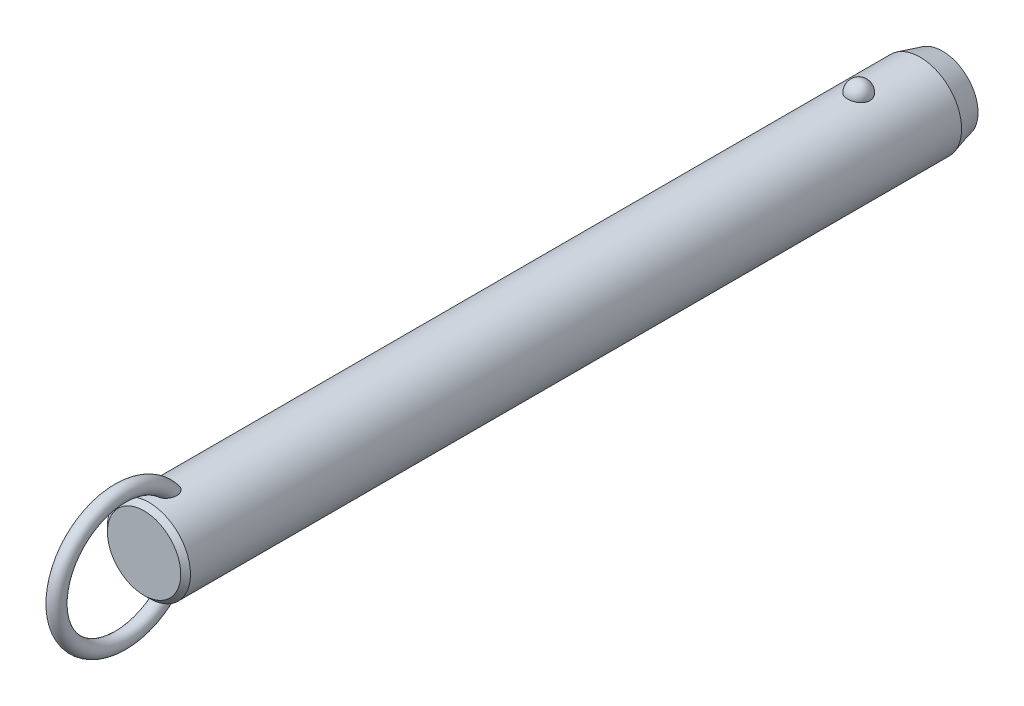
ISO-10303-21;
HEADER;
FILE_DESCRIPTION(('STEP AP214'),'2;1');
FILE_NAME('part.step','',(''),(''),'','','');
FILE_SCHEMA(('AUTOMOTIVE_DESIGN { 1 0 10303 214 1 1 1 1 }'));
ENDSEC;
DATA;
#1=APPLICATION_CONTEXT('core data for automotive mechanical design processes');
#2=APPLICATION_PROTOCOL_DEFINITION('international standard','automotive_design',2000,#1);
#3=PRODUCT_CONTEXT('',#1,'mechanical');
#4=PRODUCT('Part','Part','',(#3));
#5=PRODUCT_RELATED_PRODUCT_CATEGORY('part','',(#4));
#6=PRODUCT_DEFINITION_FORMATION('','',#4);
#7=PRODUCT_DEFINITION_CONTEXT('part definition',#1,'design');
#8=PRODUCT_DEFINITION('design','',#6,#7);
#9=PRODUCT_DEFINITION_SHAPE('','',#8);
#10=(LENGTH_UNIT() NAMED_UNIT(*) SI_UNIT(.MILLI.,.METRE.));
#11=(NAMED_UNIT(*) PLANE_ANGLE_UNIT() SI_UNIT($,.RADIAN.));
#12=(NAMED_UNIT(*) SI_UNIT($,.STERADIAN.) SOLID_ANGLE_UNIT());
#13=UNCERTAINTY_MEASURE_WITH_UNIT(LENGTH_MEASURE(1.E-05),#10,'distance_accuracy_value','');
#14=(GEOMETRIC_REPRESENTATION_CONTEXT(3) GLOBAL_UNCERTAINTY_ASSIGNED_CONTEXT((#13)) GLOBAL_UNIT_ASSIGNED_CONTEXT((#10,
#11,#12)) REPRESENTATION_CONTEXT('',''));
#15=CARTESIAN_POINT('',(0.,0.,0.));
#16=DIRECTION('',(0.,0.,1.));
#17=DIRECTION('',(1.,0.,0.));
#18=AXIS2_PLACEMENT_3D('',#15,#16,#17);
#19=CARTESIAN_POINT('',(0.,0.,175.3));
#20=DIRECTION('',(0.,0.,-1.));
#21=DIRECTION('',(-1.,0.,0.));
#22=AXIS2_PLACEMENT_3D('',#19,#20,#21);
#23=CYLINDRICAL_SURFACE('',#22,11.1);
#24=CARTESIAN_POINT('',(2.9724815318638,10.6945945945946,-3.00000000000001));
#25=CARTESIAN_POINT('',(2.9724783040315,10.6945972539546,-2.8322505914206));
#26=CARTESIAN_POINT('',(2.95876598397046,10.6984356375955,-2.66445972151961));
#27=CARTESIAN_POINT('',(2.90424529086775,10.7133624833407,-2.3336238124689));
#28=CARTESIAN_POINT('',(2.8634252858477,10.7244540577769,-2.17058084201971));
#29=CARTESIAN_POINT('',(2.75573657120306,10.7526272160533,-1.85396767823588));
#30=CARTESIAN_POINT('',(2.68887937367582,10.7697061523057,-1.70039333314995));
#31=CARTESIAN_POINT('',(2.53079696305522,10.8079438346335,-1.4069159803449));
#32=CARTESIAN_POINT('',(2.43957264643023,10.8291024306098,-1.26701246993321));
#33=CARTESIAN_POINT('',(2.23458150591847,10.8732541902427,-1.00409565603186));
#34=CARTESIAN_POINT('',(2.12071295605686,10.8962553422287,-0.88116297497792));
#35=CARTESIAN_POINT('',(1.87365402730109,10.9414421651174,-0.656352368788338));
#36=CARTESIAN_POINT('',(1.74046358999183,10.9636278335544,-0.554474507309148));
#37=CARTESIAN_POINT('',(1.45872188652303,11.0046495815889,-0.374872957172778));
#38=CARTESIAN_POINT('',(1.31021276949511,11.0234944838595,-0.297085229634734));
#39=CARTESIAN_POINT('',(1.00170030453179,11.0557957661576,-0.167529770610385));
#40=CARTESIAN_POINT('',(0.841698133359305,11.0692526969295,-0.115759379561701));
#41=CARTESIAN_POINT('',(0.51760779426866,11.0890932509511,-0.040392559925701));
#42=CARTESIAN_POINT('',(0.353633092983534,11.0955916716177,-0.0163383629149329));
#43=CARTESIAN_POINT('',(0.0238420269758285,11.1011989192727,0.0044517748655));
#44=CARTESIAN_POINT('',(-0.141974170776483,11.1003084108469,0.00119017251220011));
#45=CARTESIAN_POINT('',(-0.468405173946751,11.0912990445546,-0.0323233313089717));
#46=CARTESIAN_POINT('',(-0.629059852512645,11.0832767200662,-0.0622147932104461));
#47=CARTESIAN_POINT('',(-0.942937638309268,11.0609962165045,-0.147645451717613));
#48=CARTESIAN_POINT('',(-1.09616062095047,11.0467379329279,-0.20318507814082));
#49=CARTESIAN_POINT('',(-1.39181061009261,11.0134071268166,-0.338752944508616));
#50=CARTESIAN_POINT('',(-1.53417383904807,10.9943086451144,-0.418913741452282));
#51=CARTESIAN_POINT('',(-1.80342160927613,10.9533667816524,-0.601448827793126));
#52=CARTESIAN_POINT('',(-1.9303046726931,10.9315231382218,-0.703825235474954));
#53=CARTESIAN_POINT('',(-2.16747598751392,10.887005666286,-0.93009164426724));
#54=CARTESIAN_POINT('',(-2.27742774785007,10.8643239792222,-1.05433291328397));
#55=CARTESIAN_POINT('',(-2.47517316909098,10.8209886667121,-1.31966633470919));
#56=CARTESIAN_POINT('',(-2.56296538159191,10.8003351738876,-1.46075958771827));
#57=CARTESIAN_POINT('',(-2.71500300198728,10.7631304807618,-1.75753646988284));
#58=CARTESIAN_POINT('',(-2.77898901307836,10.7466250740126,-1.91335887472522));
#59=CARTESIAN_POINT('',(-2.88046189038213,10.7198747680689,-2.23391529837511));
#60=CARTESIAN_POINT('',(-2.91794947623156,10.709629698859,-2.3986490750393));
#61=CARTESIAN_POINT('',(-2.96537819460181,10.6965949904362,-2.73165170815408));
#62=CARTESIAN_POINT('',(-2.97542891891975,10.693775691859,-2.89990378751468));
#63=CARTESIAN_POINT('',(-2.96804271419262,10.6958279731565,-3.23575286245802));
#64=CARTESIAN_POINT('',(-2.95060646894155,10.7006993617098,-3.4033498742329));
#65=CARTESIAN_POINT('',(-2.88883358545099,10.71753912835,-3.73233906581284));
#66=CARTESIAN_POINT('',(-2.84462026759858,10.7294749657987,-3.89375610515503));
#67=CARTESIAN_POINT('',(-2.73050447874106,10.7590797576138,-4.20667949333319));
#68=CARTESIAN_POINT('',(-2.66060103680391,10.7767489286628,-4.35818546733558));
#69=CARTESIAN_POINT('',(-2.49642559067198,10.8159599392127,-4.64785421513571));
#70=CARTESIAN_POINT('',(-2.40203047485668,10.8375211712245,-4.78594458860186));
#71=CARTESIAN_POINT('',(-2.19143488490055,10.8820570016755,-5.04410382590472));
#72=CARTESIAN_POINT('',(-2.07523364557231,10.9050316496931,-5.16417205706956));
#73=CARTESIAN_POINT('',(-1.82361254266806,10.9499219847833,-5.3833483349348));
#74=CARTESIAN_POINT('',(-1.68812945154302,10.9718338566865,-5.48238464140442));
#75=CARTESIAN_POINT('',(-1.40191298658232,11.0120611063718,-5.65618873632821));
#76=CARTESIAN_POINT('',(-1.25118062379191,11.0303767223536,-5.73095813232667));
#77=CARTESIAN_POINT('',(-0.940570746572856,11.0611653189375,-5.85334725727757));
#78=CARTESIAN_POINT('',(-0.780821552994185,11.0737044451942,-5.90127578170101));
#79=CARTESIAN_POINT('',(-0.455204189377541,11.0918598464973,-5.9699297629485));
#80=CARTESIAN_POINT('',(-0.289336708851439,11.0974768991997,-5.99065827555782));
#81=CARTESIAN_POINT('',(0.0406846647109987,11.1011307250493,-6.00418773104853));
#82=CARTESIAN_POINT('',(0.204817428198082,11.099299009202,-5.99747318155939));
#83=CARTESIAN_POINT('',(0.5295530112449,11.088551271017,-5.95740317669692));
#84=CARTESIAN_POINT('',(0.690155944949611,11.0796354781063,-5.92404858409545));
#85=CARTESIAN_POINT('',(1.0027760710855,11.0557204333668,-5.83180084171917));
#86=CARTESIAN_POINT('',(1.15482001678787,11.0407414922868,-5.7729929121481));
#87=CARTESIAN_POINT('',(1.44678373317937,11.0062913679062,-5.63147366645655));
#88=CARTESIAN_POINT('',(1.58670279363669,10.9868199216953,-5.54876095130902));
#89=CARTESIAN_POINT('',(1.8527023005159,10.9451315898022,-5.36027644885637));
#90=CARTESIAN_POINT('',(1.97855158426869,10.9228788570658,-5.25418644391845));
#91=CARTESIAN_POINT('',(2.21080872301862,10.8782509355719,-5.02251354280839));
#92=CARTESIAN_POINT('',(2.31721312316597,10.8558757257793,-4.89692718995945));
#93=CARTESIAN_POINT('',(2.50945517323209,10.8130715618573,-4.62745408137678));
#94=CARTESIAN_POINT('',(2.59493284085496,10.7926798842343,-4.48330448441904));
#95=CARTESIAN_POINT('',(2.740862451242,10.7565495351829,-4.18236358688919));
#96=CARTESIAN_POINT('',(2.80132490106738,10.7408089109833,-4.02557762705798));
#97=CARTESIAN_POINT('',(2.88959070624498,10.7173718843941,-3.72475308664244));
#98=CARTESIAN_POINT('',(2.92062102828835,10.7088950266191,-3.58171216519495));
#99=CARTESIAN_POINT('',(2.96206765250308,10.6975052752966,-3.29245795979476));
#100=CARTESIAN_POINT('',(2.97248434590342,10.6945922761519,-3.14624473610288));
#101=CARTESIAN_POINT('',(2.9724815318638,10.6945945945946,-3.00000000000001));
#102=B_SPLINE_CURVE_WITH_KNOTS('',3,(#24,#25,#26,#27,#28,#29,#30,#31,#32,#33,#34,#35,#36,#37,
#38,#39,#40,#41,#42,#43,#44,#45,#46,#47,#48,#49,#50,#51,#52,#53,#54,#55,#56,#57,#58,#59,#60,#61,
#62,#63,#64,#65,#66,#67,#68,#69,#70,#71,#72,#73,#74,#75,#76,#77,#78,#79,#80,#81,#82,#83,#84,#85,
#86,#87,#88,#89,#90,#91,#92,#93,#94,#95,#96,#97,#98,#99,#100,#101),.UNSPECIFIED.,.T.,.F.,(4,2,2,
2,2,2,2,2,2,2,2,2,2,2,2,2,2,2,2,2,2,2,2,2,2,2,2,2,2,2,2,2,2,2,2,2,2,2,4),(0.,0.502722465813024,
1.00566079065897,1.5083769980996,2.01107471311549,2.51608392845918,3.02109467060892,
3.52475118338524,4.02835620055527,4.52351860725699,5.0186364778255,5.50715297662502,
5.99567766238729,6.48688002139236,6.97812923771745,7.47814366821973,7.97819077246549,
8.48353712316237,8.98886974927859,9.49218093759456,9.99547960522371,10.4964777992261,
10.997494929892,11.5010810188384,12.0046847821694,12.5099796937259,13.0152411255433,
13.5145635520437,14.0138298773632,14.5043200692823,14.9947943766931,15.4836390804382,
15.9725123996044,16.4685040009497,16.9645836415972,17.4686765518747,17.972557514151,
18.410841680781,18.849117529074),.UNSPECIFIED.);
#103=CARTESIAN_POINT('',(2.9724815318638,10.6945945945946,-3.00000000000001));
#104=VERTEX_POINT('',#103);
#105=EDGE_CURVE('E41',#104,#104,#102,.T.);
#106=ORIENTED_EDGE('',*,*,#105,.T.);
#107=EDGE_LOOP('',(#106));
#108=FACE_BOUND('',#107,.T.);
#109=CARTESIAN_POINT('',(0.,0.,186.7));
#110=DIRECTION('',(0.,0.,1.));
#111=DIRECTION('',(1.,0.,0.));
#112=AXIS2_PLACEMENT_3D('',#109,#110,#111);
#113=CIRCLE('',#112,11.1);
#114=CARTESIAN_POINT('',(11.1,0.,186.7));
#115=VERTEX_POINT('',#114);
#116=EDGE_CURVE('E10',#115,#115,#113,.F.);
#117=ORIENTED_EDGE('',*,*,#116,.T.);
#118=EDGE_LOOP('',(#117));
#119=FACE_BOUND('',#118,.T.);
#120=CARTESIAN_POINT('',(-0.564520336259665,-11.0856356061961,178.957815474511));
#121=CARTESIAN_POINT('',(-0.667202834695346,-11.0804062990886,178.991283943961));
#122=CARTESIAN_POINT('',(-0.766875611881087,-11.0738877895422,179.033835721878));
#123=CARTESIAN_POINT('',(-0.95728412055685,-11.0590576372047,179.135419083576));
#124=CARTESIAN_POINT('',(-1.04801616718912,-11.0507452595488,179.19445742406));
#125=CARTESIAN_POINT('',(-1.21800952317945,-11.0333016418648,179.326529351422));
#126=CARTESIAN_POINT('',(-1.2973080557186,-11.0241732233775,179.399515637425));
#127=CARTESIAN_POINT('',(-1.44337665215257,-11.0060026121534,179.557037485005));
#128=CARTESIAN_POINT('',(-1.51014622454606,-10.9969604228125,179.641573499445));
#129=CARTESIAN_POINT('',(-1.63454620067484,-10.9791841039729,179.825521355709));
#130=CARTESIAN_POINT('',(-1.69127003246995,-10.9705107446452,179.925549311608));
#131=CARTESIAN_POINT('',(-1.7898078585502,-10.9548648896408,180.132790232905));
#132=CARTESIAN_POINT('',(-1.83161214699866,-10.9478935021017,180.240007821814));
#133=CARTESIAN_POINT('',(-1.91557028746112,-10.9335803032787,180.505408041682));
#134=CARTESIAN_POINT('',(-1.95040620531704,-10.9273269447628,180.665980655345));
#135=CARTESIAN_POINT('',(-1.99388326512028,-10.9194709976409,180.990697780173));
#136=CARTESIAN_POINT('',(-2.00248051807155,-10.9178762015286,181.154847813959));
#137=CARTESIAN_POINT('',(-1.99551615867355,-10.9191578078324,181.524650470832));
#138=CARTESIAN_POINT('',(-1.9732206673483,-10.9232807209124,181.730191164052));
#139=CARTESIAN_POINT('',(-1.9152976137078,-10.9335244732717,182.033595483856));
#140=CARTESIAN_POINT('',(-1.89184575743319,-10.9376266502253,182.134088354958));
#141=CARTESIAN_POINT('',(-1.83700674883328,-10.9469720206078,182.332855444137));
#142=CARTESIAN_POINT('',(-1.80562070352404,-10.9522150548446,182.431129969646));
#143=CARTESIAN_POINT('',(-1.73463055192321,-10.9636837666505,182.625914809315));
#144=CARTESIAN_POINT('',(-1.69493416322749,-10.9699202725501,182.722390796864));
#145=CARTESIAN_POINT('',(-1.60745141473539,-10.9830806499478,182.911626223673));
#146=CARTESIAN_POINT('',(-1.55966150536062,-10.9900048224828,183.004384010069));
#147=CARTESIAN_POINT('',(-1.45591812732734,-11.0042280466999,183.184690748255));
#148=CARTESIAN_POINT('',(-1.40000013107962,-11.0115253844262,183.272260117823));
#149=CARTESIAN_POINT('',(-1.27937470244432,-11.0261911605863,183.441029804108));
#150=CARTESIAN_POINT('',(-1.21467835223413,-11.0335594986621,183.52223795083));
#151=CARTESIAN_POINT('',(-1.08218150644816,-11.0473027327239,183.669001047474));
#152=CARTESIAN_POINT('',(-1.01522633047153,-11.0537063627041,183.735309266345));
#153=CARTESIAN_POINT('',(-0.872952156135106,-11.065850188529,183.858378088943));
#154=CARTESIAN_POINT('',(-0.797642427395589,-11.0715911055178,183.915149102));
#155=CARTESIAN_POINT('',(-0.651396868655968,-11.081071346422,184.007515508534));
#156=CARTESIAN_POINT('',(-0.581712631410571,-11.0849841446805,184.045049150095));
#157=CARTESIAN_POINT('',(-0.43706608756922,-11.0916271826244,184.108259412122));
#158=CARTESIAN_POINT('',(-0.362109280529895,-11.0943586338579,184.133948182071));
#159=CARTESIAN_POINT('',(-0.207828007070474,-11.0983242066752,184.171117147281));
#160=CARTESIAN_POINT('',(-0.12846771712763,-11.0995432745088,184.182454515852));
#161=CARTESIAN_POINT('',(0.0309101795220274,-11.1002423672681,184.188965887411));
#162=CARTESIAN_POINT('',(0.110927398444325,-11.0997233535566,184.184148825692));
#163=CARTESIAN_POINT('',(0.256406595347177,-11.097240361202,184.160959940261));
#164=CARTESIAN_POINT('',(0.322235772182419,-11.0955074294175,184.144754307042));
#165=CARTESIAN_POINT('',(0.450635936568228,-11.0910350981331,184.102600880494));
#166=CARTESIAN_POINT('',(0.513205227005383,-11.0882951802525,184.076648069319));
#167=CARTESIAN_POINT('',(0.662626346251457,-11.0805620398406,184.002607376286));
#168=CARTESIAN_POINT('',(0.747127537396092,-11.0751144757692,183.949845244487));
#169=CARTESIAN_POINT('',(0.906756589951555,-11.0631932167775,183.831720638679));
#170=CARTESIAN_POINT('',(0.981859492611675,-11.0567168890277,183.766325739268));
#171=CARTESIAN_POINT('',(1.10712207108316,-11.0447856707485,183.64226337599));
#172=CARTESIAN_POINT('',(1.15909566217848,-11.0394280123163,183.585383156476));
#173=CARTESIAN_POINT('',(1.25791923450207,-11.0286040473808,183.467327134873));
#174=CARTESIAN_POINT('',(1.30476642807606,-11.0231376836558,183.406149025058));
#175=CARTESIAN_POINT('',(1.43818612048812,-11.0068027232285,183.217305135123));
#176=CARTESIAN_POINT('',(1.51751767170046,-10.9960104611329,183.084453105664));
#177=CARTESIAN_POINT('',(1.63597546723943,-10.9788847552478,182.853137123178));
#178=CARTESIAN_POINT('',(1.67988876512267,-10.9722190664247,182.757053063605));
#179=CARTESIAN_POINT('',(1.75953241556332,-10.9597298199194,182.561431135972));
#180=CARTESIAN_POINT('',(1.7952596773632,-10.9539065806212,182.461891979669));
#181=CARTESIAN_POINT('',(1.85844731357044,-10.9433632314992,182.26021118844));
#182=CARTESIAN_POINT('',(1.88591073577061,-10.9386427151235,182.15807052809));
#183=CARTESIAN_POINT('',(1.93234324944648,-10.9305350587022,181.951819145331));
#184=CARTESIAN_POINT('',(1.95131065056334,-10.9271481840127,181.847708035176));
#185=CARTESIAN_POINT('',(1.9904020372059,-10.9201183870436,181.565458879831));
#186=CARTESIAN_POINT('',(2.00221217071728,-10.9179256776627,181.386037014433));
#187=CARTESIAN_POINT('',(1.99711676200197,-10.9188636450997,181.027713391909));
#188=CARTESIAN_POINT('',(1.98026150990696,-10.9219849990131,180.848811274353));
#189=CARTESIAN_POINT('',(1.92151657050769,-10.9324473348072,180.53645144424));
#190=CARTESIAN_POINT('',(1.88605081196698,-10.9386915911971,180.401759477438));
#191=CARTESIAN_POINT('',(1.79393020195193,-10.9541780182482,180.139966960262));
#192=CARTESIAN_POINT('',(1.73729868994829,-10.9634168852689,180.012858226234));
#193=CARTESIAN_POINT('',(1.61237037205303,-10.9824218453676,179.789418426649));
#194=CARTESIAN_POINT('',(1.54715374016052,-10.9918945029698,179.691345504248));
#195=CARTESIAN_POINT('',(1.40127026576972,-11.0114415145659,179.507434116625));
#196=CARTESIAN_POINT('',(1.32060742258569,-11.0215157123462,179.421592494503));
#197=CARTESIAN_POINT('',(1.1447478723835,-11.041168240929,179.265163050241));
#198=CARTESIAN_POINT('',(1.04947805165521,-11.0507437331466,179.194656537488));
#199=CARTESIAN_POINT('',(0.847278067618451,-11.0680789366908,179.072640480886));
#200=CARTESIAN_POINT('',(0.74035174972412,-11.0758392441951,179.021124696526));
#201=CARTESIAN_POINT('',(0.529289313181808,-11.0878275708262,178.943485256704));
#202=CARTESIAN_POINT('',(0.425895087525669,-11.0923259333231,178.915377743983));
#203=CARTESIAN_POINT('',(0.215723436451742,-11.0984001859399,178.877703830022));
#204=CARTESIAN_POINT('',(0.108947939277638,-11.0999777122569,178.868127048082));
#205=CARTESIAN_POINT('',(-0.0938962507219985,-11.1000196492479,178.867877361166));
#206=CARTESIAN_POINT('',(-0.189967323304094,-11.0987797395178,178.875408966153));
#207=CARTESIAN_POINT('',(-0.379657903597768,-11.0939111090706,178.905507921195));
#208=CARTESIAN_POINT('',(-0.47327735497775,-11.0902823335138,178.928075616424));
#209=CARTESIAN_POINT('',(-0.564520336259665,-11.0856356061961,178.957815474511));
#210=B_SPLINE_CURVE_WITH_KNOTS('',3,(#120,#121,#122,#123,#124,#125,#126,#127,#128,#129,#130,
#131,#132,#133,#134,#135,#136,#137,#138,#139,#140,#141,#142,#143,#144,#145,#146,#147,#148,#149,
#150,#151,#152,#153,#154,#155,#156,#157,#158,#159,#160,#161,#162,#163,#164,#165,#166,#167,#168,
#169,#170,#171,#172,#173,#174,#175,#176,#177,#178,#179,#180,#181,#182,#183,#184,#185,#186,#187,
#188,#189,#190,#191,#192,#193,#194,#195,#196,#197,#198,#199,#200,#201,#202,#203,#204,#205,#206,
#207,#208,#209),.UNSPECIFIED.,.T.,.F.,(4,2,2,2,2,2,2,2,2,2,2,2,2,2,2,2,2,2,2,2,2,2,2,2,2,2,2,2,
2,2,2,2,2,2,2,2,2,2,2,2,2,2,2,2,4),(0.,0.323999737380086,0.64813245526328,0.971184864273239,
1.29424994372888,1.63886237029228,1.98369857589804,2.47426059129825,2.96564271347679,
3.58257396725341,3.89215258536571,4.20168803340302,4.51486273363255,4.82817514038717,
5.14015911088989,5.45175282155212,5.73442856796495,6.01679375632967,6.2536458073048,
6.49025437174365,6.72919963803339,6.96801276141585,7.17061258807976,7.37331685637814,
7.67094989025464,7.96935728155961,8.20075067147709,8.4322692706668,8.89581623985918,
9.21306533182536,9.53043400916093,9.84768549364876,10.1650000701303,10.7022930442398,
11.2386443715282,11.655339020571,12.071575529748,12.4245637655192,12.7774607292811,
13.1321855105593,13.4867936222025,13.8068771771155,14.1267813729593,14.4146787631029,
14.7025827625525),.UNSPECIFIED.);
#211=CARTESIAN_POINT('',(-0.564520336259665,-11.0856356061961,178.957815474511));
#212=VERTEX_POINT('',#211);
#213=EDGE_CURVE('E60',#212,#212,#210,.T.);
#214=ORIENTED_EDGE('',*,*,#213,.T.);
#215=EDGE_LOOP('',(#214));
#216=FACE_BOUND('',#215,.T.);
#217=CARTESIAN_POINT('',(-0.564520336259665,11.0856356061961,178.957815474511));
#218=CARTESIAN_POINT('',(-0.468542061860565,11.0905203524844,178.926545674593));
#219=CARTESIAN_POINT('',(-0.369793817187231,11.0942886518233,178.903157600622));
#220=CARTESIAN_POINT('',(-0.169555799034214,11.0991586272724,178.873085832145));
#221=CARTESIAN_POINT('',(-0.0680604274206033,11.1002543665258,178.86643932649));
#222=CARTESIAN_POINT('',(0.134549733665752,11.099646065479,178.870157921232));
#223=CARTESIAN_POINT('',(0.235664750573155,11.0979441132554,178.88051033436));
#224=CARTESIAN_POINT('',(0.434632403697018,11.0919342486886,178.917831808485));
#225=CARTESIAN_POINT('',(0.532486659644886,11.0876276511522,178.944792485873));
#226=CARTESIAN_POINT('',(0.722445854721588,11.0768742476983,179.0144096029));
#227=CARTESIAN_POINT('',(0.814543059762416,11.0704246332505,179.057086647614));
#228=CARTESIAN_POINT('',(0.990565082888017,11.0560659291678,179.156648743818));
#229=CARTESIAN_POINT('',(1.07448844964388,11.048156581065,179.213536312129));
#230=CARTESIAN_POINT('',(1.23562672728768,11.0313221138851,179.342210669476));
#231=CARTESIAN_POINT('',(1.31242684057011,11.0223686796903,179.414511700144));
#232=CARTESIAN_POINT('',(1.45398030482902,11.0045918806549,179.570042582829));
#233=CARTESIAN_POINT('',(1.51873073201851,10.9957685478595,179.653275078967));
#234=CARTESIAN_POINT('',(1.64107232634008,10.9782087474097,179.836384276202));
#235=CARTESIAN_POINT('',(1.6974317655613,10.9695572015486,179.937089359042));
#236=CARTESIAN_POINT('',(1.79515063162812,10.9539887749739,180.145626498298));
#237=CARTESIAN_POINT('',(1.83649966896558,10.9470730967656,180.25346343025));
#238=CARTESIAN_POINT('',(1.91931148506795,10.9329211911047,180.520399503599));
#239=CARTESIAN_POINT('',(1.95340104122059,10.9267904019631,180.681861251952));
#240=CARTESIAN_POINT('',(1.99526195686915,10.9192174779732,181.00821631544));
#241=CARTESIAN_POINT('',(2.00298989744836,10.9177830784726,181.17311484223));
#242=CARTESIAN_POINT('',(1.99396251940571,10.9194420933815,181.544100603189));
#243=CARTESIAN_POINT('',(1.97050829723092,10.923774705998,181.75003871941));
#244=CARTESIAN_POINT('',(1.91079643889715,10.9343131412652,182.053901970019));
#245=CARTESIAN_POINT('',(1.88673702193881,10.9385106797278,182.154529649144));
#246=CARTESIAN_POINT('',(1.8306550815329,10.9480376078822,182.353510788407));
#247=CARTESIAN_POINT('',(1.79863369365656,10.9533668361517,182.451864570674));
#248=CARTESIAN_POINT('',(1.72633365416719,10.9649954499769,182.646720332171));
#249=CARTESIAN_POINT('',(1.68596409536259,10.9713053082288,182.74318790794));
#250=CARTESIAN_POINT('',(1.59707998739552,10.9845964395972,182.932323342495));
#251=CARTESIAN_POINT('',(1.54856169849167,10.9915780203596,183.024989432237));
#252=CARTESIAN_POINT('',(1.44330168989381,11.0058935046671,183.204975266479));
#253=CARTESIAN_POINT('',(1.3865974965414,11.0132257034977,183.292316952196));
#254=CARTESIAN_POINT('',(1.2643115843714,11.0279330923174,183.460456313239));
#255=CARTESIAN_POINT('',(1.19874160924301,11.0353082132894,183.541262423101));
#256=CARTESIAN_POINT('',(1.06542088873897,11.048931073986,183.685985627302));
#257=CARTESIAN_POINT('',(0.998640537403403,11.0552153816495,183.750784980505));
#258=CARTESIAN_POINT('',(0.856896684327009,11.0671032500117,183.870846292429));
#259=CARTESIAN_POINT('',(0.781942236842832,11.0727075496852,183.926118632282));
#260=CARTESIAN_POINT('',(0.636276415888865,11.081949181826,184.015972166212));
#261=CARTESIAN_POINT('',(0.566755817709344,11.0857572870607,184.052441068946));
#262=CARTESIAN_POINT('',(0.422602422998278,11.0921860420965,184.113533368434));
#263=CARTESIAN_POINT('',(0.347974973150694,11.0948079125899,184.138168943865));
#264=CARTESIAN_POINT('',(0.194593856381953,11.0985608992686,184.173323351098));
#265=CARTESIAN_POINT('',(0.115807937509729,11.0996777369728,184.183706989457));
#266=CARTESIAN_POINT('',(-0.0422499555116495,11.1002003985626,184.188574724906));
#267=CARTESIAN_POINT('',(-0.121521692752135,11.09960699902,184.183066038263));
#268=CARTESIAN_POINT('',(-0.266046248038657,11.0970123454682,184.158827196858));
#269=CARTESIAN_POINT('',(-0.331661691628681,11.0952283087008,184.142135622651));
#270=CARTESIAN_POINT('',(-0.459588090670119,11.0906663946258,184.099111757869));
#271=CARTESIAN_POINT('',(-0.52189737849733,11.0878880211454,184.072774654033));
#272=CARTESIAN_POINT('',(-0.671446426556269,11.0800342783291,183.997513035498));
#273=CARTESIAN_POINT('',(-0.756250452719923,11.0744969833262,183.943818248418));
#274=CARTESIAN_POINT('',(-0.916349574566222,11.0624045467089,183.823802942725));
#275=CARTESIAN_POINT('',(-0.991618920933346,11.0558467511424,183.757449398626));
#276=CARTESIAN_POINT('',(-1.11713140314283,11.0437783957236,183.631633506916));
#277=CARTESIAN_POINT('',(-1.16920539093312,11.0383619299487,183.573952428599));
#278=CARTESIAN_POINT('',(-1.26817476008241,11.02743010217,183.454280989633));
#279=CARTESIAN_POINT('',(-1.31506731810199,11.0219146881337,183.392288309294));
#280=CARTESIAN_POINT('',(-1.40399813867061,11.0109399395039,183.264784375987));
#281=CARTESIAN_POINT('',(-1.44602864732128,11.0054807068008,183.199267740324));
#282=CARTESIAN_POINT('',(-1.52538779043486,10.9947621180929,183.065422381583));
#283=CARTESIAN_POINT('',(-1.56271516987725,10.9895028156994,182.997092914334));
#284=CARTESIAN_POINT('',(-1.64537943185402,10.9774790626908,182.833210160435));
#285=CARTESIAN_POINT('',(-1.68879497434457,10.9708503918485,182.7366735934));
#286=CARTESIAN_POINT('',(-1.76740738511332,10.9584602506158,182.540236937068));
#287=CARTESIAN_POINT('',(-1.80260120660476,10.95269910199,182.44033561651));
#288=CARTESIAN_POINT('',(-1.86468657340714,10.9423003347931,182.237966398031));
#289=CARTESIAN_POINT('',(-1.8915816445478,10.9376622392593,182.135499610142));
#290=CARTESIAN_POINT('',(-1.93682458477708,10.9297405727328,181.928642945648));
#291=CARTESIAN_POINT('',(-1.95517082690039,10.9264572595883,181.824252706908));
#292=CARTESIAN_POINT('',(-1.99232562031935,10.9197647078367,181.54262876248));
#293=CARTESIAN_POINT('',(-2.00294603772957,10.9177914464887,181.364185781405));
#294=CARTESIAN_POINT('',(-1.99566675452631,10.9191290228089,181.007996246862));
#295=CARTESIAN_POINT('',(-1.97781651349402,10.9224306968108,180.83024902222));
#296=CARTESIAN_POINT('',(-1.91747214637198,10.9331592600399,180.519792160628));
#297=CARTESIAN_POINT('',(-1.88131022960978,10.9395108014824,180.385825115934));
#298=CARTESIAN_POINT('',(-1.78790380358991,10.9551659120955,180.12559757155));
#299=CARTESIAN_POINT('',(-1.73068309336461,10.9644661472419,179.999328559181));
#300=CARTESIAN_POINT('',(-1.60475573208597,10.9835398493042,179.77741565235));
#301=CARTESIAN_POINT('',(-1.53908879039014,10.9930297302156,179.680026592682));
#302=CARTESIAN_POINT('',(-1.39238608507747,11.0125708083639,179.497525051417));
#303=CARTESIAN_POINT('',(-1.31135150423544,11.0226219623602,179.412411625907));
#304=CARTESIAN_POINT('',(-1.14382035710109,11.0411991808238,179.26529943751));
#305=CARTESIAN_POINT('',(-1.0585850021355,11.0497792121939,179.20186930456));
#306=CARTESIAN_POINT('',(-0.878723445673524,11.0655285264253,179.090250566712));
#307=CARTESIAN_POINT('',(-0.784123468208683,11.0727015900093,179.042020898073));
#308=CARTESIAN_POINT('',(-0.646163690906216,11.0812501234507,178.986023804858));
#309=CARTESIAN_POINT('',(-0.605595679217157,11.0835451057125,178.971197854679));
#310=CARTESIAN_POINT('',(-0.564520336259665,11.0856356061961,178.957815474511));
#311=B_SPLINE_CURVE_WITH_KNOTS('',3,(#217,#218,#219,#220,#221,#222,#223,#224,#225,#226,#227,
#228,#229,#230,#231,#232,#233,#234,#235,#236,#237,#238,#239,#240,#241,#242,#243,#244,#245,#246,
#247,#248,#249,#250,#251,#252,#253,#254,#255,#256,#257,#258,#259,#260,#261,#262,#263,#264,#265,
#266,#267,#268,#269,#270,#271,#272,#273,#274,#275,#276,#277,#278,#279,#280,#281,#282,#283,#284,
#285,#286,#287,#288,#289,#290,#291,#292,#293,#294,#295,#296,#297,#298,#299,#300,#301,#302,#303,
#304,#305,#306,#307,#308,#309,#310),.UNSPECIFIED.,.T.,.F.,(4,2,2,2,2,2,2,2,2,2,2,2,2,2,2,2,2,2,
2,2,2,2,2,2,2,2,2,2,2,2,2,2,2,2,2,2,2,2,2,2,2,2,2,2,2,2,4),(0.,0.303061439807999,
0.606795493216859,0.910302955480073,1.21365733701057,1.51741085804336,1.82121821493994,
2.1374520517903,2.45376252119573,2.79958678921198,3.14564996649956,3.63832391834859,
4.13180893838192,4.75031912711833,5.06071926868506,5.37107516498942,5.6850077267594,
5.99908475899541,6.31176519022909,6.62403542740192,6.90315673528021,7.18197194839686,
7.41687778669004,7.65154134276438,7.88841587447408,8.12518286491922,8.32752842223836,
8.52997509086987,8.82986421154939,9.13054668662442,9.36393502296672,9.59744991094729,
9.83133221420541,10.0652767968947,10.383032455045,10.7009056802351,11.0186436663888,
11.3364420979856,11.8705925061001,12.4038159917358,12.8189662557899,13.2336487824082,
13.5857049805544,13.9377340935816,14.2561354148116,14.5736690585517,14.7033687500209),.UNSPECIFIED.);
#312=CARTESIAN_POINT('',(-0.564520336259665,11.0856356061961,178.957815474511));
#313=VERTEX_POINT('',#312);
#314=EDGE_CURVE('E67',#313,#313,#311,.T.);
#315=ORIENTED_EDGE('',*,*,#314,.T.);
#316=EDGE_LOOP('',(#315));
#317=FACE_BOUND('',#316,.T.);
#318=CARTESIAN_POINT('',(0.,0.,-19.3999999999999));
#319=DIRECTION('',(0.,0.,-1.));
#320=DIRECTION('',(-1.,0.,0.));
#321=AXIS2_PLACEMENT_3D('',#318,#319,#320);
#322=CIRCLE('',#321,11.1);
#323=CARTESIAN_POINT('',(-11.1,0.,-19.3999999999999));
#324=VERTEX_POINT('',#323);
#325=EDGE_CURVE('E57',#324,#324,#322,.F.);
#326=ORIENTED_EDGE('',*,*,#325,.T.);
#327=EDGE_LOOP('',(#326));
#328=FACE_BOUND('',#327,.T.);
#329=ADVANCED_FACE('F37',(#108,#119,#216,#317,#328),#23,.T.);
#330=CARTESIAN_POINT('',(0.,0.,-25.4));
#331=DIRECTION('',(0.,0.,-1.));
#332=DIRECTION('',(-1.,0.,0.));
#333=AXIS2_PLACEMENT_3D('',#330,#331,#332);
#334=PLANE('',#333);
#335=CARTESIAN_POINT('',(0.,0.,-25.4));
#336=DIRECTION('',(0.,0.,-1.));
#337=DIRECTION('',(-1.,0.,0.));
#338=AXIS2_PLACEMENT_3D('',#335,#336,#337);
#339=CIRCLE('',#338,9.49230484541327);
#340=CARTESIAN_POINT('',(-9.49230484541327,0.,-25.4));
#341=VERTEX_POINT('',#340);
#342=EDGE_CURVE('E66',#341,#341,#339,.T.);
#343=ORIENTED_EDGE('',*,*,#342,.T.);
#344=EDGE_LOOP('',(#343));
#345=FACE_BOUND('',#344,.T.);
#346=ADVANCED_FACE('F85',(#345),#334,.T.);
#347=CARTESIAN_POINT('',(0.,0.,-25.4));
#348=DIRECTION('',(0.,0.,1.));
#349=DIRECTION('',(1.,0.,0.));
#350=AXIS2_PLACEMENT_3D('',#347,#348,#349);
#351=CONICAL_SURFACE('',#350,9.49230484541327,0.261799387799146);
#352=ORIENTED_EDGE('',*,*,#325,.F.);
#353=EDGE_LOOP('',(#352));
#354=FACE_BOUND('',#353,.T.);
#355=ORIENTED_EDGE('',*,*,#342,.F.);
#356=EDGE_LOOP('',(#355));
#357=FACE_BOUND('',#356,.T.);
#358=ADVANCED_FACE('F83',(#354,#357),#351,.T.);
#359=CARTESIAN_POINT('',(0.,0.,188.));
#360=DIRECTION('',(0.,0.,1.));
#361=DIRECTION('',(1.,0.,0.));
#362=AXIS2_PLACEMENT_3D('',#359,#360,#361);
#363=PLANE('',#362);
#364=CARTESIAN_POINT('',(0.,0.,188.));
#365=DIRECTION('',(0.,0.,1.));
#366=DIRECTION('',(1.,0.,0.));
#367=AXIS2_PLACEMENT_3D('',#364,#365,#366);
#368=CIRCLE('',#367,9.80000000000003);
#369=CARTESIAN_POINT('',(9.80000000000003,0.,188.));
#370=VERTEX_POINT('',#369);
#371=EDGE_CURVE('E50',#370,#370,#368,.T.);
#372=ORIENTED_EDGE('',*,*,#371,.T.);
#373=EDGE_LOOP('',(#372));
#374=FACE_BOUND('',#373,.T.);
#375=ADVANCED_FACE('F77',(#374),#363,.T.);
#376=CARTESIAN_POINT('',(0.,0.,194.35));
#377=DIRECTION('',(1.,0.,0.));
#378=DIRECTION('',(0.,0.,-1.));
#379=AXIS2_PLACEMENT_3D('',#376,#377,#378);
#380=TOROIDAL_SURFACE('',#379,17.05,2.);
#381=ORIENTED_EDGE('',*,*,#314,.F.);
#382=EDGE_LOOP('',(#381));
#383=FACE_BOUND('',#382,.T.);
#384=ORIENTED_EDGE('',*,*,#213,.F.);
#385=EDGE_LOOP('',(#384));
#386=FACE_BOUND('',#385,.T.);
#387=ADVANCED_FACE('F73',(#383,#386),#380,.T.);
#388=CARTESIAN_POINT('',(0.,0.,188.));
#389=DIRECTION('',(0.,0.,-1.));
#390=DIRECTION('',(-1.,0.,0.));
#391=AXIS2_PLACEMENT_3D('',#388,#389,#390);
#392=CONICAL_SURFACE('',#391,9.80000000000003,0.785398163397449);
#393=ORIENTED_EDGE('',*,*,#116,.F.);
#394=EDGE_LOOP('',(#393));
#395=FACE_BOUND('',#394,.T.);
#396=ORIENTED_EDGE('',*,*,#371,.F.);
#397=EDGE_LOOP('',(#396));
#398=FACE_BOUND('',#397,.T.);
#399=ADVANCED_FACE('F39',(#395,#398),#392,.T.);
#400=CARTESIAN_POINT('',(0.,11.1,-3.00000000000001));
#401=DIRECTION('',(0.,1.,0.));
#402=DIRECTION('',(0.,0.,-1.));
#403=AXIS2_PLACEMENT_3D('',#400,#401,#402);
#404=SPHERICAL_SURFACE('',#403,3.);
#405=ORIENTED_EDGE('',*,*,#105,.F.);
#406=EDGE_LOOP('',(#405));
#407=FACE_BOUND('',#406,.T.);
#408=ADVANCED_FACE('F79',(#407),#404,.T.);
#409=CLOSED_SHELL('',(#329,#346,#358,#375,#387,#399,#408));
#410=MANIFOLD_SOLID_BREP('B2',#409);
#411=ADVANCED_BREP_SHAPE_REPRESENTATION('',(#18,#410),#14);
#412=SHAPE_DEFINITION_REPRESENTATION(#9,#411);
ENDSEC;
END-ISO-10303-21;
